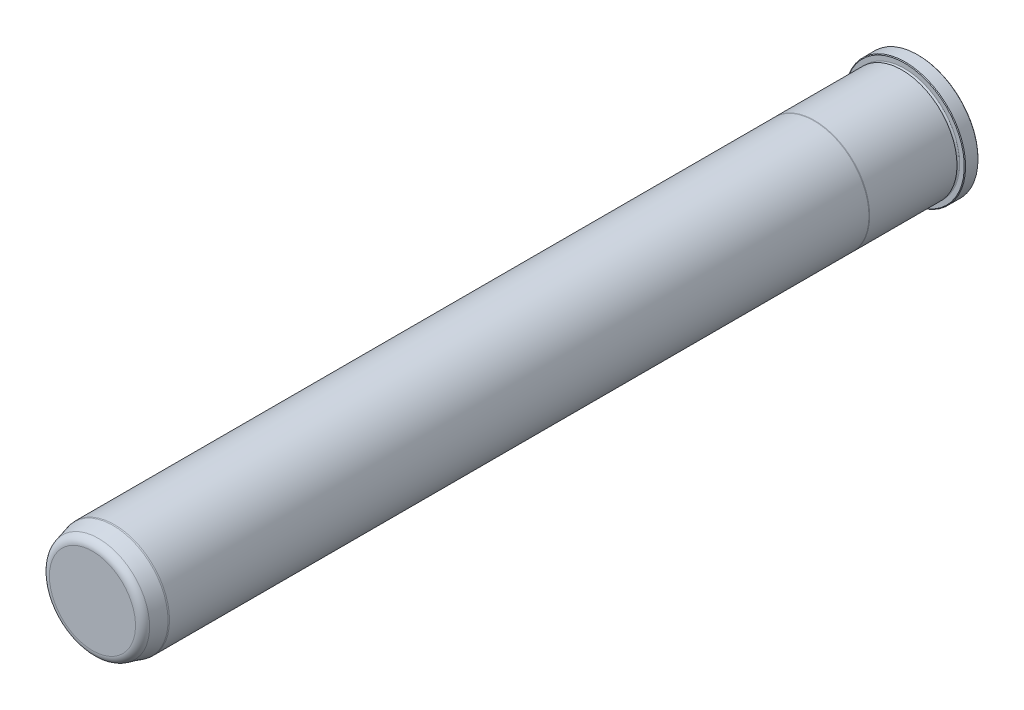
ISO-10303-21;
HEADER;
FILE_DESCRIPTION(('STEP AP214'),'2;1');
FILE_NAME('part.step','',(''),(''),'','','');
FILE_SCHEMA(('AUTOMOTIVE_DESIGN { 1 0 10303 214 1 1 1 1 }'));
ENDSEC;
DATA;
#1=APPLICATION_CONTEXT('core data for automotive mechanical design processes');
#2=APPLICATION_PROTOCOL_DEFINITION('international standard','automotive_design',2000,#1);
#3=PRODUCT_CONTEXT('',#1,'mechanical');
#4=PRODUCT('Part','Part','',(#3));
#5=PRODUCT_RELATED_PRODUCT_CATEGORY('part','',(#4));
#6=PRODUCT_DEFINITION_FORMATION('','',#4);
#7=PRODUCT_DEFINITION_CONTEXT('part definition',#1,'design');
#8=PRODUCT_DEFINITION('design','',#6,#7);
#9=PRODUCT_DEFINITION_SHAPE('','',#8);
#10=(LENGTH_UNIT() NAMED_UNIT(*) SI_UNIT(.MILLI.,.METRE.));
#11=(NAMED_UNIT(*) PLANE_ANGLE_UNIT() SI_UNIT($,.RADIAN.));
#12=(NAMED_UNIT(*) SI_UNIT($,.STERADIAN.) SOLID_ANGLE_UNIT());
#13=UNCERTAINTY_MEASURE_WITH_UNIT(LENGTH_MEASURE(1.E-05),#10,'distance_accuracy_value','');
#14=(GEOMETRIC_REPRESENTATION_CONTEXT(3) GLOBAL_UNCERTAINTY_ASSIGNED_CONTEXT((#13)) GLOBAL_UNIT_ASSIGNED_CONTEXT((#10,
#11,#12)) REPRESENTATION_CONTEXT('',''));
#15=CARTESIAN_POINT('',(0.,0.,0.));
#16=DIRECTION('',(0.,0.,1.));
#17=DIRECTION('',(1.,0.,0.));
#18=AXIS2_PLACEMENT_3D('',#15,#16,#17);
#19=CARTESIAN_POINT('',(0.,0.,0.));
#20=DIRECTION('',(0.,0.,1.));
#21=DIRECTION('',(1.,0.,0.));
#22=AXIS2_PLACEMENT_3D('',#19,#20,#21);
#23=PLANE('',#22);
#24=CARTESIAN_POINT('',(0.,0.,0.));
#25=DIRECTION('',(0.,0.,1.));
#26=DIRECTION('',(1.,0.,0.));
#27=AXIS2_PLACEMENT_3D('',#24,#25,#26);
#28=CIRCLE('',#27,34.417);
#29=CARTESIAN_POINT('',(34.417,0.,0.));
#30=VERTEX_POINT('',#29);
#31=EDGE_CURVE('E37',#30,#30,#28,.F.);
#32=ORIENTED_EDGE('',*,*,#31,.T.);
#33=EDGE_LOOP('',(#32));
#34=FACE_BOUND('',#33,.T.);
#35=ADVANCED_FACE('F30',(#34),#23,.F.);
#36=CARTESIAN_POINT('',(0.,0.,0.));
#37=DIRECTION('',(0.,0.,1.));
#38=DIRECTION('',(1.,0.,0.));
#39=AXIS2_PLACEMENT_3D('',#36,#37,#38);
#40=CYLINDRICAL_SURFACE('',#39,34.798);
#41=CARTESIAN_POINT('',(0.,0.,0.381000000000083));
#42=DIRECTION('',(0.,0.,1.));
#43=DIRECTION('',(1.,0.,0.));
#44=AXIS2_PLACEMENT_3D('',#41,#42,#43);
#45=CIRCLE('',#44,34.798);
#46=CARTESIAN_POINT('',(34.798,0.,0.381000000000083));
#47=VERTEX_POINT('',#46);
#48=EDGE_CURVE('E41',#47,#47,#45,.T.);
#49=ORIENTED_EDGE('',*,*,#48,.T.);
#50=EDGE_LOOP('',(#49));
#51=FACE_BOUND('',#50,.T.);
#52=CARTESIAN_POINT('',(0.,0.,7.54380000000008));
#53=DIRECTION('',(0.,0.,-1.));
#54=DIRECTION('',(-1.,0.,0.));
#55=AXIS2_PLACEMENT_3D('',#52,#53,#54);
#56=CIRCLE('',#55,34.798);
#57=CARTESIAN_POINT('',(-34.798,0.,7.54380000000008));
#58=VERTEX_POINT('',#57);
#59=EDGE_CURVE('E45',#58,#58,#56,.T.);
#60=ORIENTED_EDGE('',*,*,#59,.T.);
#61=EDGE_LOOP('',(#60));
#62=FACE_BOUND('',#61,.T.);
#63=ADVANCED_FACE('F118',(#51,#62),#40,.T.);
#64=CARTESIAN_POINT('',(0.,34.798,7.9248));
#65=DIRECTION('',(0.,0.,-1.));
#66=DIRECTION('',(-1.,0.,0.));
#67=AXIS2_PLACEMENT_3D('',#64,#65,#66);
#68=PLANE('',#67);
#69=CARTESIAN_POINT('',(0.,0.,7.9248));
#70=DIRECTION('',(0.,0.,-1.));
#71=DIRECTION('',(-1.,0.,0.));
#72=AXIS2_PLACEMENT_3D('',#69,#70,#71);
#73=CIRCLE('',#72,34.4170000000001);
#74=CARTESIAN_POINT('',(-34.4170000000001,0.,7.9248));
#75=VERTEX_POINT('',#74);
#76=EDGE_CURVE('E10',#75,#75,#73,.F.);
#77=ORIENTED_EDGE('',*,*,#76,.T.);
#78=EDGE_LOOP('',(#77));
#79=FACE_BOUND('',#78,.T.);
#80=CARTESIAN_POINT('',(0.,0.,7.9248));
#81=DIRECTION('',(0.,0.,1.));
#82=DIRECTION('',(1.,0.,0.));
#83=AXIS2_PLACEMENT_3D('',#80,#81,#82);
#84=CIRCLE('',#83,31.7373);
#85=CARTESIAN_POINT('',(31.7373,0.,7.9248));
#86=VERTEX_POINT('',#85);
#87=EDGE_CURVE('E56',#86,#86,#84,.T.);
#88=ORIENTED_EDGE('',*,*,#87,.F.);
#89=EDGE_LOOP('',(#88));
#90=FACE_BOUND('',#89,.T.);
#91=ADVANCED_FACE('F113',(#79,#90),#68,.F.);
#92=CARTESIAN_POINT('',(0.,0.,8.6868));
#93=DIRECTION('',(0.,0.,1.));
#94=DIRECTION('',(1.,0.,0.));
#95=AXIS2_PLACEMENT_3D('',#92,#93,#94);
#96=TOROIDAL_SURFACE('',#95,31.7373,0.761999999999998);
#97=CARTESIAN_POINT('',(0.,0.,9.44879999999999));
#98=DIRECTION('',(0.,0.,1.));
#99=DIRECTION('',(1.,0.,0.));
#100=AXIS2_PLACEMENT_3D('',#97,#98,#99);
#101=CIRCLE('',#100,31.7373);
#102=CARTESIAN_POINT('',(31.7373,0.,9.44879999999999));
#103=VERTEX_POINT('',#102);
#104=EDGE_CURVE('E59',#103,#103,#101,.T.);
#105=ORIENTED_EDGE('',*,*,#104,.F.);
#106=EDGE_LOOP('',(#105));
#107=FACE_BOUND('',#106,.T.);
#108=ORIENTED_EDGE('',*,*,#87,.T.);
#109=EDGE_LOOP('',(#108));
#110=FACE_BOUND('',#109,.T.);
#111=ADVANCED_FACE('F107',(#107,#110),#96,.F.);
#112=CARTESIAN_POINT('',(0.,31.7373,9.44879999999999));
#113=DIRECTION('',(0.,0.,1.));
#114=DIRECTION('',(1.,0.,0.));
#115=AXIS2_PLACEMENT_3D('',#112,#113,#114);
#116=PLANE('',#115);
#117=CARTESIAN_POINT('',(0.,0.,9.4488));
#118=DIRECTION('',(0.,0.,1.));
#119=DIRECTION('',(1.,0.,0.));
#120=AXIS2_PLACEMENT_3D('',#117,#118,#119);
#121=CIRCLE('',#120,31.7627);
#122=CARTESIAN_POINT('',(31.7627,0.,9.4488));
#123=VERTEX_POINT('',#122);
#124=EDGE_CURVE('E62',#123,#123,#121,.T.);
#125=ORIENTED_EDGE('',*,*,#124,.F.);
#126=EDGE_LOOP('',(#125));
#127=FACE_BOUND('',#126,.T.);
#128=ORIENTED_EDGE('',*,*,#104,.T.);
#129=EDGE_LOOP('',(#128));
#130=FACE_BOUND('',#129,.T.);
#131=ADVANCED_FACE('F101',(#127,#130),#116,.F.);
#132=CARTESIAN_POINT('',(0.,0.,0.));
#133=DIRECTION('',(0.,0.,1.));
#134=DIRECTION('',(1.,0.,0.));
#135=AXIS2_PLACEMENT_3D('',#132,#133,#134);
#136=CYLINDRICAL_SURFACE('',#135,31.7627);
#137=CARTESIAN_POINT('',(0.,0.,59.8347630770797));
#138=DIRECTION('',(0.,0.,1.));
#139=DIRECTION('',(1.,0.,0.));
#140=AXIS2_PLACEMENT_3D('',#137,#138,#139);
#141=CIRCLE('',#140,31.7627);
#142=CARTESIAN_POINT('',(31.7627,0.,59.8347630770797));
#143=VERTEX_POINT('',#142);
#144=EDGE_CURVE('E65',#143,#143,#141,.T.);
#145=ORIENTED_EDGE('',*,*,#144,.F.);
#146=EDGE_LOOP('',(#145));
#147=FACE_BOUND('',#146,.T.);
#148=ORIENTED_EDGE('',*,*,#124,.T.);
#149=EDGE_LOOP('',(#148));
#150=FACE_BOUND('',#149,.T.);
#151=ADVANCED_FACE('F95',(#147,#150),#136,.T.);
#152=CARTESIAN_POINT('',(0.,0.,59.8347630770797));
#153=DIRECTION('',(0.,0.,-1.));
#154=DIRECTION('',(-1.,0.,0.));
#155=AXIS2_PLACEMENT_3D('',#152,#153,#154);
#156=CONICAL_SURFACE('',#155,31.7627,0.0698131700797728);
#157=CARTESIAN_POINT('',(0.,0.,60.198));
#158=DIRECTION('',(0.,0.,1.));
#159=DIRECTION('',(1.,0.,0.));
#160=AXIS2_PLACEMENT_3D('',#157,#158,#159);
#161=CIRCLE('',#160,31.7373);
#162=CARTESIAN_POINT('',(31.7373,0.,60.198));
#163=VERTEX_POINT('',#162);
#164=EDGE_CURVE('E68',#163,#163,#161,.T.);
#165=ORIENTED_EDGE('',*,*,#164,.F.);
#166=EDGE_LOOP('',(#165));
#167=FACE_BOUND('',#166,.T.);
#168=ORIENTED_EDGE('',*,*,#144,.T.);
#169=EDGE_LOOP('',(#168));
#170=FACE_BOUND('',#169,.T.);
#171=ADVANCED_FACE('F89',(#167,#170),#156,.T.);
#172=CARTESIAN_POINT('',(0.,0.,0.));
#173=DIRECTION('',(0.,0.,1.));
#174=DIRECTION('',(1.,0.,0.));
#175=AXIS2_PLACEMENT_3D('',#172,#173,#174);
#176=CYLINDRICAL_SURFACE('',#175,31.7373);
#177=CARTESIAN_POINT('',(0.,0.,463.55));
#178=DIRECTION('',(0.,0.,1.));
#179=DIRECTION('',(1.,0.,0.));
#180=AXIS2_PLACEMENT_3D('',#177,#178,#179);
#181=CIRCLE('',#180,31.7373);
#182=CARTESIAN_POINT('',(31.7373,0.,463.55));
#183=VERTEX_POINT('',#182);
#184=EDGE_CURVE('E71',#183,#183,#181,.T.);
#185=ORIENTED_EDGE('',*,*,#184,.F.);
#186=EDGE_LOOP('',(#185));
#187=FACE_BOUND('',#186,.T.);
#188=ORIENTED_EDGE('',*,*,#164,.T.);
#189=EDGE_LOOP('',(#188));
#190=FACE_BOUND('',#189,.T.);
#191=ADVANCED_FACE('F83',(#187,#190),#176,.T.);
#192=CARTESIAN_POINT('',(0.,0.,463.55));
#193=DIRECTION('',(0.,0.,-1.));
#194=DIRECTION('',(-1.,0.,0.));
#195=AXIS2_PLACEMENT_3D('',#192,#193,#194);
#196=CONICAL_SURFACE('',#195,31.7373,0.0872664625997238);
#197=CARTESIAN_POINT('',(0.,0.,464.312));
#198=DIRECTION('',(0.,0.,1.));
#199=DIRECTION('',(1.,0.,0.));
#200=AXIS2_PLACEMENT_3D('',#197,#198,#199);
#201=CIRCLE('',#200,31.6706336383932);
#202=CARTESIAN_POINT('',(31.6706336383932,0.,464.312));
#203=VERTEX_POINT('',#202);
#204=EDGE_CURVE('E74',#203,#203,#201,.T.);
#205=ORIENTED_EDGE('',*,*,#204,.F.);
#206=EDGE_LOOP('',(#205));
#207=FACE_BOUND('',#206,.T.);
#208=ORIENTED_EDGE('',*,*,#184,.T.);
#209=EDGE_LOOP('',(#208));
#210=FACE_BOUND('',#209,.T.);
#211=ADVANCED_FACE('F80',(#207,#210),#196,.T.);
#212=CARTESIAN_POINT('',(0.,0.,464.312));
#213=DIRECTION('',(0.,0.,-1.));
#214=DIRECTION('',(-1.,0.,0.));
#215=AXIS2_PLACEMENT_3D('',#212,#213,#214);
#216=CONICAL_SURFACE('',#215,31.6706336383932,0.26179938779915);
#217=CARTESIAN_POINT('',(0.,0.,472.720125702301));
#218=DIRECTION('',(0.,0.,1.));
#219=DIRECTION('',(1.,0.,0.));
#220=AXIS2_PLACEMENT_3D('',#217,#218,#219);
#221=CIRCLE('',#220,29.4176831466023);
#222=CARTESIAN_POINT('',(29.4176831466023,0.,472.720125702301));
#223=VERTEX_POINT('',#222);
#224=EDGE_CURVE('E50',#223,#223,#221,.F.);
#225=ORIENTED_EDGE('',*,*,#224,.T.);
#226=EDGE_LOOP('',(#225));
#227=FACE_BOUND('',#226,.T.);
#228=ORIENTED_EDGE('',*,*,#204,.T.);
#229=EDGE_LOOP('',(#228));
#230=FACE_BOUND('',#229,.T.);
#231=ADVANCED_FACE('F78',(#227,#230),#216,.T.);
#232=CARTESIAN_POINT('',(0.,28.4718561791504,476.25));
#233=DIRECTION('',(0.,0.,-1.));
#234=DIRECTION('',(-1.,0.,0.));
#235=AXIS2_PLACEMENT_3D('',#232,#233,#234);
#236=PLANE('',#235);
#237=CARTESIAN_POINT('',(0.,0.,476.25));
#238=DIRECTION('',(0.,0.,-1.));
#239=DIRECTION('',(-1.,0.,0.));
#240=AXIS2_PLACEMENT_3D('',#237,#238,#239);
#241=CIRCLE('',#240,24.8174613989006);
#242=CARTESIAN_POINT('',(-24.8174613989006,0.,476.25));
#243=VERTEX_POINT('',#242);
#244=EDGE_CURVE('E53',#243,#243,#241,.F.);
#245=ORIENTED_EDGE('',*,*,#244,.T.);
#246=EDGE_LOOP('',(#245));
#247=FACE_BOUND('',#246,.T.);
#248=ADVANCED_FACE('F133',(#247),#236,.F.);
#249=CARTESIAN_POINT('',(0.,0.,471.4875));
#250=DIRECTION('',(0.,0.,-1.));
#251=DIRECTION('',(-1.,0.,0.));
#252=AXIS2_PLACEMENT_3D('',#249,#250,#251);
#253=TOROIDAL_SURFACE('',#252,24.8174613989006,4.7625);
#254=ORIENTED_EDGE('',*,*,#224,.F.);
#255=EDGE_LOOP('',(#254));
#256=FACE_BOUND('',#255,.T.);
#257=ORIENTED_EDGE('',*,*,#244,.F.);
#258=EDGE_LOOP('',(#257));
#259=FACE_BOUND('',#258,.T.);
#260=ADVANCED_FACE('F130',(#256,#259),#253,.T.);
#261=CARTESIAN_POINT('',(0.,0.,0.381000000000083));
#262=DIRECTION('',(0.,0.,1.));
#263=DIRECTION('',(1.,0.,0.));
#264=AXIS2_PLACEMENT_3D('',#261,#262,#263);
#265=CONICAL_SURFACE('',#264,34.798,0.785398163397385);
#266=ORIENTED_EDGE('',*,*,#31,.F.);
#267=EDGE_LOOP('',(#266));
#268=FACE_BOUND('',#267,.T.);
#269=ORIENTED_EDGE('',*,*,#48,.F.);
#270=EDGE_LOOP('',(#269));
#271=FACE_BOUND('',#270,.T.);
#272=ADVANCED_FACE('F132',(#268,#271),#265,.T.);
#273=CARTESIAN_POINT('',(0.,0.,7.9248));
#274=DIRECTION('',(0.,0.,-1.));
#275=DIRECTION('',(-1.,0.,0.));
#276=AXIS2_PLACEMENT_3D('',#273,#274,#275);
#277=CONICAL_SURFACE('',#276,34.4170000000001,0.785398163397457);
#278=ORIENTED_EDGE('',*,*,#59,.F.);
#279=EDGE_LOOP('',(#278));
#280=FACE_BOUND('',#279,.T.);
#281=ORIENTED_EDGE('',*,*,#76,.F.);
#282=EDGE_LOOP('',(#281));
#283=FACE_BOUND('',#282,.T.);
#284=ADVANCED_FACE('F32',(#280,#283),#277,.T.);
#285=CLOSED_SHELL('',(#35,#63,#91,#111,#131,#151,#171,#191,#211,#231,#248,#260,#272,#284));
#286=MANIFOLD_SOLID_BREP('B2',#285);
#287=ADVANCED_BREP_SHAPE_REPRESENTATION('',(#18,#286),#14);
#288=SHAPE_DEFINITION_REPRESENTATION(#9,#287);
ENDSEC;
END-ISO-10303-21;
